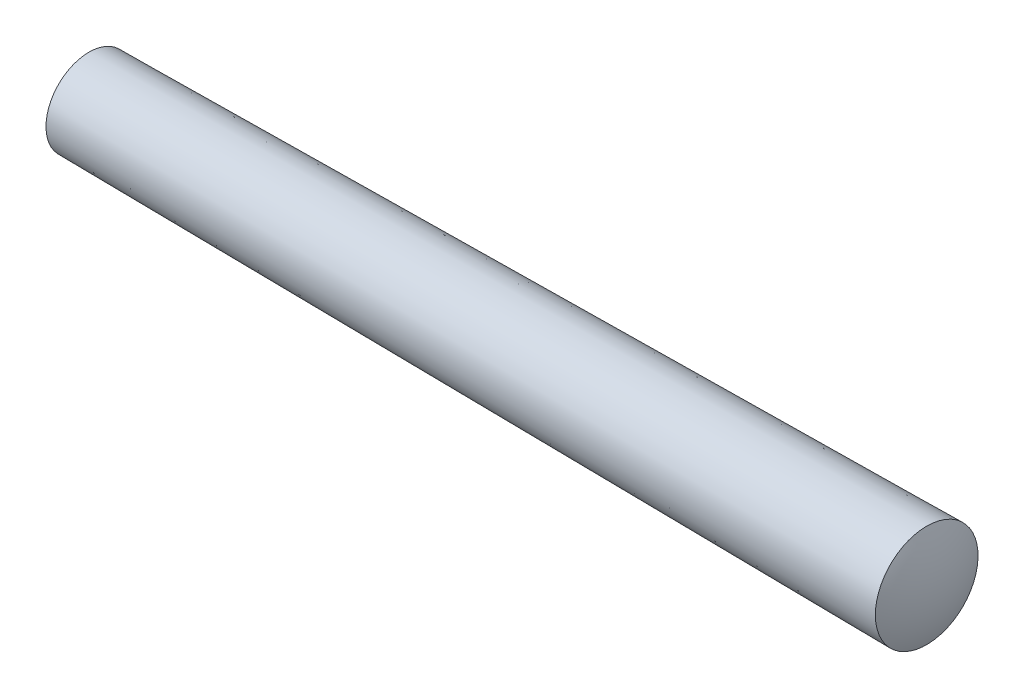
from build123d import *


with BuildPart() as part:
    # Sketch1 → Base-Revolve (revolve)
    with BuildSketch(Plane.XY):
        with BuildLine():
            Line((0.63, 2.5), (49.37, 2.987399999))
            ThreePointArc((49.37, 2.987399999), (49.840786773, 1.526553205), (50, 0))
            Line((50, 0), (0, 0))
            ThreePointArc((0, 0), (0.159924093, 1.289079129), (0.63, 2.5))
        make_face()
    revolve(axis=Axis((0, 0, 0), (1, 0, 0)))


solid = part.part
